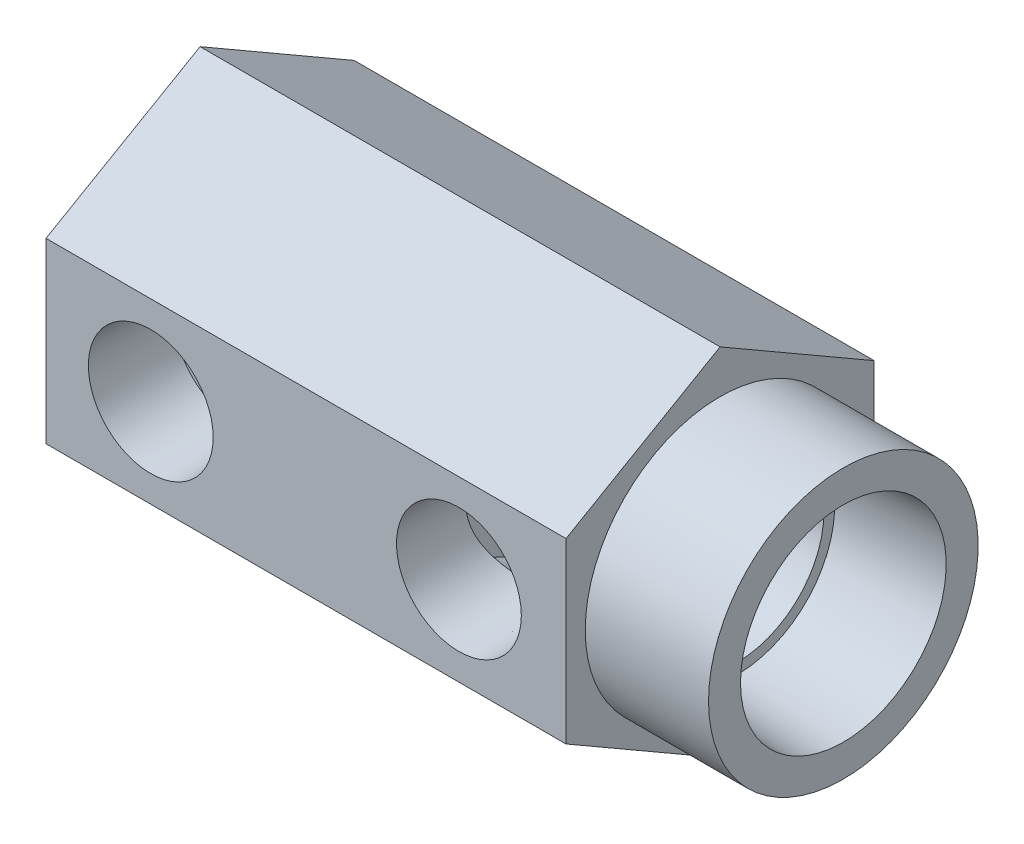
from build123d import *

# Parameters (mm, degrees)
BOSS_EXTRUDE1_DEPTH                = 42.8625
SKETCH2_R                          = 11.1125
BOSS_EXTRUDE2_DEPTH                = 53.0225
F_1_8_NPT_TAPPED_HOLE1_AT_2_COUNT  = 2
F_1_8_NPT_TAPPED_HOLE1_AT_2_PITCH  = 25.4
I_0_272_DIAMETER_HOLE1_D           = 6.9088
I_0_272_DIAMETER_HOLE1_DEPTH       = 44.45
I_0_272_DIAMETER_HOLE1_TIP         = 2.075612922
F_5_16_0_3125_DIAMETER_HOLE1_D     = 7.9375
F_5_16_0_3125_DIAMETER_HOLE1_DEPTH = 36.576
F_5_16_0_3125_DIAMETER_HOLE1_TIP   = 2.384665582


with BuildPart() as part:
    # Sketch1 → Boss-Extrude1 (new body)
    with BuildSketch(Plane(origin=(0, 0, 0), x_dir=(0, 0, -1), z_dir=(1, 0, 0))):
        Polygon((-12.7, -7.332348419), (0, -14.664696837), (12.7, -7.332348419), (12.7, 7.332348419), (0, 14.664696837), (-12.7, 7.332348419), align=None)
    extrude(amount=BOSS_EXTRUDE1_DEPTH)

    # Sketch2 → Boss-Extrude2 (add)
    with BuildSketch(Plane.ZY):
        Circle(SKETCH2_R)
    extrude(amount=-BOSS_EXTRUDE2_DEPTH)

    # Sketch3 → Cut-Revolve1 (revolve, cut)
    with BuildSketch(Plane.XY, mode=Mode.PRIVATE) as cut_revolve1_sk:
        Polygon((53.0225, 0), (53.0225, 8.47725), (44.2849, 8.019331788), (44.2849, 7.1374), (27.6225, 7.1374), (27.6225, 0), align=None)
    revolve(cut_revolve1_sk.sketch.rotate(Axis((0, 0, 0), (1, 0, 0)), 90), axis=Axis((0, 0, 0), (1, 0, 0)), mode=Mode.SUBTRACT)

    # Sketch4 → 1_8 NPT Tapped Hole1 (revolve, cut)
    with BuildSketch(Plane(origin=(8.636, 0, 12.7), x_dir=(0, -1, 0), z_dir=(1, 0, 0))):
        Polygon((0, 0), (0, 18.408468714), (4.2164, 15.875), (4.2164, 6.92404), (4.93618497, 6.92404), (5.1435, 0), align=None)
    f_1_8_npt_tapped_hole1 = revolve(axis=Axis((8.636, 0, 19.05), (0, 0, -1)), mode=Mode.SUBTRACT)

    # 1_8 NPT Tapped Hole1 at 2: 1_8 NPT Tapped Hole1 ×2
    with Locations(*[(i * F_1_8_NPT_TAPPED_HOLE1_AT_2_PITCH, 0, 0) for i in range(1, F_1_8_NPT_TAPPED_HOLE1_AT_2_COUNT)]):
        add(f_1_8_npt_tapped_hole1, mode=Mode.SUBTRACT)

    # Sketch6 → 1_8 NPT Tapped Hole2 (revolve, cut)
    with BuildSketch(Plane(origin=(8.636, 0, -12.7), x_dir=(0, 1, 0), z_dir=(1, 0, 0))):
        Polygon((0, 0), (0, 18.408468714), (4.2164, 15.875), (4.2164, 6.92404), (4.93618497, 6.92404), (5.1435, 0), align=None)
    revolve(axis=Axis((8.636, 0, -19.05), (0, 0, 1)), mode=Mode.SUBTRACT)

    # I _0.272_ Diameter Hole1
    with Locations(Plane(origin=(53.0225, 0, 0), x_dir=(0, 0, -1), z_dir=(1, 0, 0))):
        with Locations((0, 0)):
            Hole(I_0_272_DIAMETER_HOLE1_D / 2, depth=I_0_272_DIAMETER_HOLE1_DEPTH)
            with Locations((0, 0, -(I_0_272_DIAMETER_HOLE1_DEPTH + I_0_272_DIAMETER_HOLE1_TIP / 2))):  # 118° drill point
                Cone(0, I_0_272_DIAMETER_HOLE1_D / 2, I_0_272_DIAMETER_HOLE1_TIP, mode=Mode.SUBTRACT)

    # 5_16 _0.3125_ Diameter Hole1
    with Locations(Plane(origin=(53.0225, 0, 0), x_dir=(0, 0, -1), z_dir=(1, 0, 0))):
        with Locations((0, 0)):
            Hole(F_5_16_0_3125_DIAMETER_HOLE1_D / 2, depth=F_5_16_0_3125_DIAMETER_HOLE1_DEPTH)
            with Locations((0, 0, -(F_5_16_0_3125_DIAMETER_HOLE1_DEPTH + F_5_16_0_3125_DIAMETER_HOLE1_TIP / 2))):  # 118° drill point
                Cone(0, F_5_16_0_3125_DIAMETER_HOLE1_D / 2, F_5_16_0_3125_DIAMETER_HOLE1_TIP, mode=Mode.SUBTRACT)


solid = part.part
